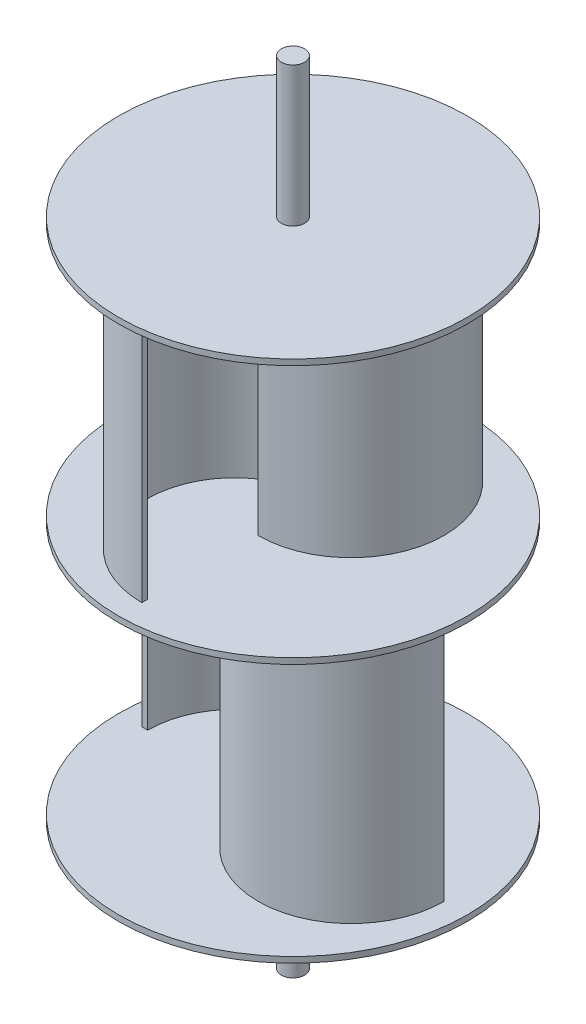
from build123d import *

# Parameters (mm, degrees)
SKETCH1_R                = 150
BOSS_EXTRUDE1_DEPTH      = 5
EXTRUDE_THIN1_DEPTH      = 217.5
SKETCH3_R                = 10
BOSS_EXTRUDE2_DEPTH      = 435
SKETCH4_R                = 150
BOSS_EXTRUDE3_DEPTH      = 5
EXTRUDE_THIN2_DEPTH      = 217.5
SKETCH6_R                = 150
BOSS_EXTRUDE4_DEPTH      = 5
BOSS_EXTRUDE5_DEPTH      = 120
BOSS_EXTRUDE5_DEPTH_BACK = 560
SKETCH7_R                = 10


with BuildPart() as part:
    # Sketch1 → Boss-Extrude1 (new body)
    with BuildSketch(Plane(origin=(0, 0, 0), x_dir=(1, 0, 0), z_dir=(0, 1, 0))):
        with Locations(Location((0, 0, 0), (0, 0, 270))):
            Circle(SKETCH1_R)
    extrude(amount=BOSS_EXTRUDE1_DEPTH)

    # Sketch2 → Extrude-Thin1 (add)
    with BuildSketch(Plane(origin=(0, 5, 0), x_dir=(1, 0, 0), z_dir=(0, 1, 0))):
        with BuildLine():
            ThreePointArc((25, 0), (-50, 75), (-125, 0))
            Line((-125, 0), (-130, 0))
            ThreePointArc((-130, 0), (-50, 80), (30, 0))
            Line((30, 0), (25, 0))
        make_face()
        with BuildLine():
            ThreePointArc((-25, 0), (50, -75), (125, 0))
            Line((125, 0), (130, 0))
            ThreePointArc((130, 0), (50, -80), (-30, 0))
            Line((-30, 0), (-25, 0))
        make_face()
    extrude(amount=EXTRUDE_THIN1_DEPTH)

    # Sketch3 → Boss-Extrude2 (add)
    with BuildSketch(Plane(origin=(0, 5, 0), x_dir=(1, 0, 0), z_dir=(0, 1, 0))):
        with Locations(Location((0, 0, 0), (0, 0, 90))):
            Circle(SKETCH3_R)
    extrude(amount=BOSS_EXTRUDE2_DEPTH)

    # Sketch4 → Boss-Extrude3 (add)
    with BuildSketch(Plane(origin=(0, 222.5, 0), x_dir=(1, 0, 0), z_dir=(0, 1, 0))):
        with Locations(Location((0, 0, 0), (0, 0, 270))):
            Circle(SKETCH4_R)
    extrude(amount=BOSS_EXTRUDE3_DEPTH)

    # Sketch5 → Extrude-Thin2 (add)
    with BuildSketch(Plane(origin=(0, 227.5, 0), x_dir=(1, 0, 0), z_dir=(0, 1, 0))):
        with BuildLine():
            ThreePointArc((0, -25), (75, 50), (0, 125))
            Line((0, 125), (0, 130))
            ThreePointArc((0, 130), (80, 50), (0, -30))
            Line((0, -30), (0, -25))
        make_face()
        with BuildLine():
            ThreePointArc((0, 25), (-75, -50), (0, -125))
            Line((0, -125), (0, -130))
            ThreePointArc((0, -130), (-80, -50), (0, 30))
            Line((0, 30), (0, 25))
        make_face()
    extrude(amount=EXTRUDE_THIN2_DEPTH)

    # Sketch6 → Boss-Extrude4 (add)
    with BuildSketch(Plane(origin=(0, 445, 0), x_dir=(1, 0, 0), z_dir=(0, 1, 0))):
        with Locations(Location((0, 0, 0), (0, 0, 270))):
            Circle(SKETCH6_R)
    extrude(amount=BOSS_EXTRUDE4_DEPTH)

    # Sketch7 → Boss-Extrude5 (add, two sides: drawn at the far end of the back side and taken through both)
    with BuildSketch(Plane(origin=(0, 450, 0), x_dir=(1, 0, 0), z_dir=(0, 1, 0)).offset(-BOSS_EXTRUDE5_DEPTH_BACK)):
        with Locations(Location((0, 0, 0), (0, 0, 90))):
            Circle(SKETCH7_R)
    extrude(amount=BOSS_EXTRUDE5_DEPTH + BOSS_EXTRUDE5_DEPTH_BACK)


solid = part.part
